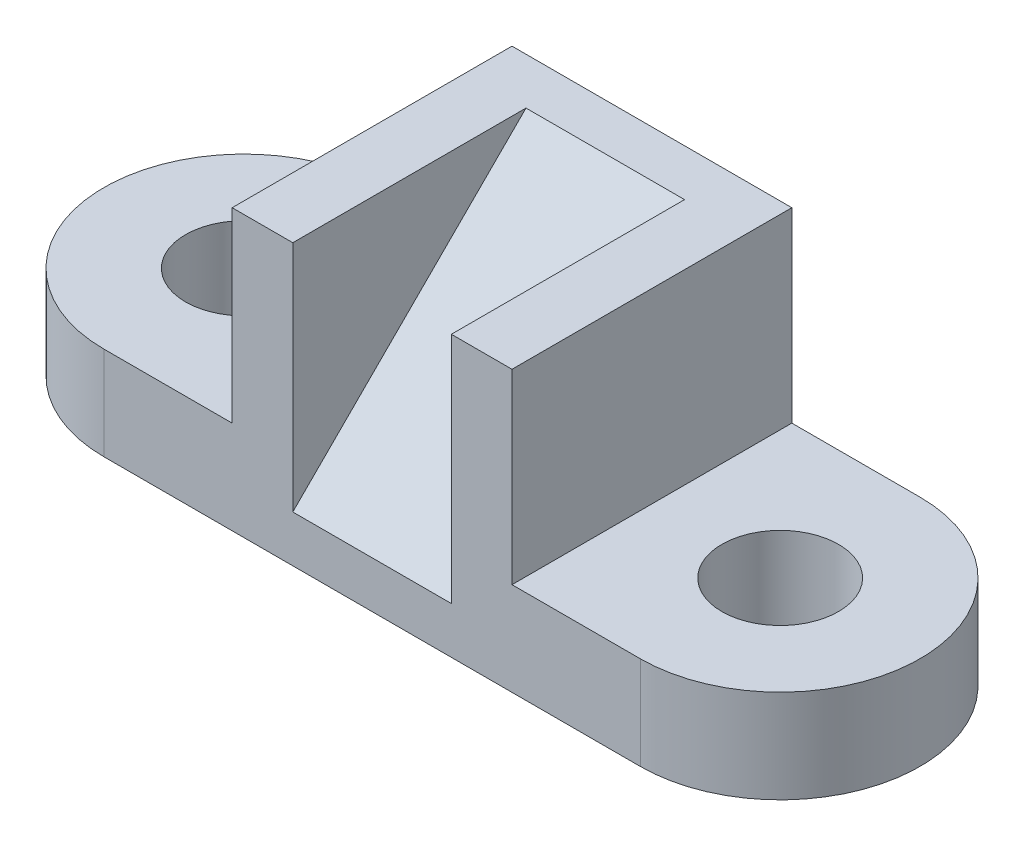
ISO-10303-21;
HEADER;
FILE_DESCRIPTION(('STEP AP214'),'2;1');
FILE_NAME('part.step','',(''),(''),'','','');
FILE_SCHEMA(('AUTOMOTIVE_DESIGN { 1 0 10303 214 1 1 1 1 }'));
ENDSEC;
DATA;
#1=APPLICATION_CONTEXT('core data for automotive mechanical design processes');
#2=APPLICATION_PROTOCOL_DEFINITION('international standard','automotive_design',2000,#1);
#3=PRODUCT_CONTEXT('',#1,'mechanical');
#4=PRODUCT('Part','Part','',(#3));
#5=PRODUCT_RELATED_PRODUCT_CATEGORY('part','',(#4));
#6=PRODUCT_DEFINITION_FORMATION('','',#4);
#7=PRODUCT_DEFINITION_CONTEXT('part definition',#1,'design');
#8=PRODUCT_DEFINITION('design','',#6,#7);
#9=PRODUCT_DEFINITION_SHAPE('','',#8);
#10=(LENGTH_UNIT() NAMED_UNIT(*) SI_UNIT(.MILLI.,.METRE.));
#11=(NAMED_UNIT(*) PLANE_ANGLE_UNIT() SI_UNIT($,.RADIAN.));
#12=(NAMED_UNIT(*) SI_UNIT($,.STERADIAN.) SOLID_ANGLE_UNIT());
#13=UNCERTAINTY_MEASURE_WITH_UNIT(LENGTH_MEASURE(1.E-05),#10,'distance_accuracy_value','');
#14=(GEOMETRIC_REPRESENTATION_CONTEXT(3) GLOBAL_UNCERTAINTY_ASSIGNED_CONTEXT((#13)) GLOBAL_UNIT_ASSIGNED_CONTEXT((#10,
#11,#12)) REPRESENTATION_CONTEXT('',''));
#15=CARTESIAN_POINT('',(0.,0.,0.));
#16=DIRECTION('',(0.,0.,1.));
#17=DIRECTION('',(1.,0.,0.));
#18=AXIS2_PLACEMENT_3D('',#15,#16,#17);
#19=CARTESIAN_POINT('',(-57.5,20.,0.));
#20=DIRECTION('',(0.,-1.,0.));
#21=DIRECTION('',(0.,0.,-1.));
#22=AXIS2_PLACEMENT_3D('',#19,#20,#21);
#23=PLANE('',#22);
#24=CARTESIAN_POINT('',(-57.5,20.,0.));
#25=DIRECTION('',(0.,1.,0.));
#26=DIRECTION('',(0.,0.,1.));
#27=AXIS2_PLACEMENT_3D('',#24,#25,#26);
#28=CIRCLE('',#27,12.5);
#29=CARTESIAN_POINT('',(-57.5,20.,12.5));
#30=VERTEX_POINT('',#29);
#31=EDGE_CURVE('E191',#30,#30,#28,.T.);
#32=ORIENTED_EDGE('',*,*,#31,.F.);
#33=EDGE_LOOP('',(#32));
#34=FACE_BOUND('',#33,.T.);
#35=DIRECTION('',(0.,0.,1.));
#36=VECTOR('',#35,1.);
#37=CARTESIAN_POINT('',(-30.,20.,-30.));
#38=LINE('',#37,#36);
#39=CARTESIAN_POINT('',(-30.,20.,-30.));
#40=VERTEX_POINT('',#39);
#41=CARTESIAN_POINT('',(-30.,20.,30.));
#42=VERTEX_POINT('',#41);
#43=EDGE_CURVE('E57',#40,#42,#38,.T.);
#44=ORIENTED_EDGE('',*,*,#43,.F.);
#45=DIRECTION('',(-1.,0.,0.));
#46=VECTOR('',#45,1.);
#47=CARTESIAN_POINT('',(-57.5,20.,-30.));
#48=LINE('',#47,#46);
#49=CARTESIAN_POINT('',(-57.5,20.,-30.));
#50=VERTEX_POINT('',#49);
#51=EDGE_CURVE('E205',#40,#50,#48,.T.);
#52=ORIENTED_EDGE('',*,*,#51,.T.);
#53=CARTESIAN_POINT('',(-57.5,20.,0.));
#54=DIRECTION('',(0.,1.,0.));
#55=DIRECTION('',(0.,0.,-1.));
#56=AXIS2_PLACEMENT_3D('',#53,#54,#55);
#57=CIRCLE('',#56,30.);
#58=CARTESIAN_POINT('',(-57.5,20.,30.));
#59=VERTEX_POINT('',#58);
#60=EDGE_CURVE('E208',#50,#59,#57,.T.);
#61=ORIENTED_EDGE('',*,*,#60,.T.);
#62=DIRECTION('',(1.,0.,0.));
#63=VECTOR('',#62,1.);
#64=CARTESIAN_POINT('',(0.,20.,30.));
#65=LINE('',#64,#63);
#66=EDGE_CURVE('E176',#59,#42,#65,.T.);
#67=ORIENTED_EDGE('',*,*,#66,.T.);
#68=EDGE_LOOP('',(#44,#52,#61,#67));
#69=FACE_BOUND('',#68,.T.);
#70=ADVANCED_FACE('F32',(#34,#69),#23,.F.);
#71=CARTESIAN_POINT('',(-57.5,0.,0.));
#72=DIRECTION('',(0.,-1.,0.));
#73=DIRECTION('',(0.,0.,-1.));
#74=AXIS2_PLACEMENT_3D('',#71,#72,#73);
#75=PLANE('',#74);
#76=DIRECTION('',(-1.,0.,0.));
#77=VECTOR('',#76,1.);
#78=CARTESIAN_POINT('',(-57.5,0.,-30.));
#79=LINE('',#78,#77);
#80=CARTESIAN_POINT('',(57.5,0.,-30.));
#81=VERTEX_POINT('',#80);
#82=CARTESIAN_POINT('',(-57.5,0.,-30.));
#83=VERTEX_POINT('',#82);
#84=EDGE_CURVE('E196',#81,#83,#79,.T.);
#85=ORIENTED_EDGE('',*,*,#84,.F.);
#86=CARTESIAN_POINT('',(57.5,0.,0.));
#87=DIRECTION('',(0.,-1.,0.));
#88=DIRECTION('',(0.,0.,-1.));
#89=AXIS2_PLACEMENT_3D('',#86,#87,#88);
#90=CIRCLE('',#89,30.);
#91=CARTESIAN_POINT('',(57.5,0.,30.));
#92=VERTEX_POINT('',#91);
#93=EDGE_CURVE('E235',#81,#92,#90,.T.);
#94=ORIENTED_EDGE('',*,*,#93,.T.);
#95=DIRECTION('',(1.,0.,0.));
#96=VECTOR('',#95,1.);
#97=CARTESIAN_POINT('',(0.,0.,30.));
#98=LINE('',#97,#96);
#99=CARTESIAN_POINT('',(-57.5,0.,30.));
#100=VERTEX_POINT('',#99);
#101=EDGE_CURVE('E203',#100,#92,#98,.T.);
#102=ORIENTED_EDGE('',*,*,#101,.F.);
#103=CARTESIAN_POINT('',(-57.5,0.,0.));
#104=DIRECTION('',(0.,1.,0.));
#105=DIRECTION('',(0.,0.,-1.));
#106=AXIS2_PLACEMENT_3D('',#103,#104,#105);
#107=CIRCLE('',#106,30.);
#108=EDGE_CURVE('E201',#83,#100,#107,.T.);
#109=ORIENTED_EDGE('',*,*,#108,.F.);
#110=EDGE_LOOP('',(#85,#94,#102,#109));
#111=FACE_BOUND('',#110,.T.);
#112=CARTESIAN_POINT('',(-57.5,0.,0.));
#113=DIRECTION('',(0.,1.,0.));
#114=DIRECTION('',(0.,0.,1.));
#115=AXIS2_PLACEMENT_3D('',#112,#113,#114);
#116=CIRCLE('',#115,12.5);
#117=CARTESIAN_POINT('',(-57.5,0.,12.5));
#118=VERTEX_POINT('',#117);
#119=EDGE_CURVE('E186',#118,#118,#116,.T.);
#120=ORIENTED_EDGE('',*,*,#119,.T.);
#121=EDGE_LOOP('',(#120));
#122=FACE_BOUND('',#121,.T.);
#123=CARTESIAN_POINT('',(57.5,0.,0.));
#124=DIRECTION('',(0.,-1.,0.));
#125=DIRECTION('',(0.,0.,1.));
#126=AXIS2_PLACEMENT_3D('',#123,#124,#125);
#127=CIRCLE('',#126,12.5);
#128=CARTESIAN_POINT('',(57.5,0.,12.5));
#129=VERTEX_POINT('',#128);
#130=EDGE_CURVE('E160',#129,#129,#127,.T.);
#131=ORIENTED_EDGE('',*,*,#130,.F.);
#132=EDGE_LOOP('',(#131));
#133=FACE_BOUND('',#132,.T.);
#134=ADVANCED_FACE('F232',(#111,#122,#133),#75,.T.);
#135=CARTESIAN_POINT('',(-57.5,20.,-30.));
#136=DIRECTION('',(0.,0.,1.));
#137=DIRECTION('',(1.,0.,0.));
#138=AXIS2_PLACEMENT_3D('',#135,#136,#137);
#139=PLANE('',#138);
#140=ORIENTED_EDGE('',*,*,#84,.T.);
#141=DIRECTION('',(0.,-1.,0.));
#142=VECTOR('',#141,1.);
#143=CARTESIAN_POINT('',(-57.5,20.,-30.));
#144=LINE('',#143,#142);
#145=EDGE_CURVE('E11',#50,#83,#144,.T.);
#146=ORIENTED_EDGE('',*,*,#145,.F.);
#147=ORIENTED_EDGE('',*,*,#51,.F.);
#148=DIRECTION('',(0.,-1.,0.));
#149=VECTOR('',#148,1.);
#150=CARTESIAN_POINT('',(-30.,60.,-30.));
#151=LINE('',#150,#149);
#152=CARTESIAN_POINT('',(-30.,60.,-30.));
#153=VERTEX_POINT('',#152);
#154=EDGE_CURVE('E182',#153,#40,#151,.T.);
#155=ORIENTED_EDGE('',*,*,#154,.F.);
#156=DIRECTION('',(-1.,0.,0.));
#157=VECTOR('',#156,1.);
#158=CARTESIAN_POINT('',(0.,60.,-30.));
#159=LINE('',#158,#157);
#160=CARTESIAN_POINT('',(30.,60.,-30.));
#161=VERTEX_POINT('',#160);
#162=EDGE_CURVE('E171',#161,#153,#159,.T.);
#163=ORIENTED_EDGE('',*,*,#162,.F.);
#164=DIRECTION('',(0.,-1.,0.));
#165=VECTOR('',#164,1.);
#166=CARTESIAN_POINT('',(30.,60.,-30.));
#167=LINE('',#166,#165);
#168=CARTESIAN_POINT('',(30.,20.,-30.));
#169=VERTEX_POINT('',#168);
#170=EDGE_CURVE('E156',#161,#169,#167,.T.);
#171=ORIENTED_EDGE('',*,*,#170,.T.);
#172=DIRECTION('',(1.,0.,0.));
#173=VECTOR('',#172,1.);
#174=CARTESIAN_POINT('',(57.5,20.,-30.));
#175=LINE('',#174,#173);
#176=CARTESIAN_POINT('',(57.5,20.,-30.));
#177=VERTEX_POINT('',#176);
#178=EDGE_CURVE('E249',#169,#177,#175,.T.);
#179=ORIENTED_EDGE('',*,*,#178,.T.);
#180=DIRECTION('',(0.,-1.,0.));
#181=VECTOR('',#180,1.);
#182=CARTESIAN_POINT('',(57.5,20.,-30.));
#183=LINE('',#182,#181);
#184=EDGE_CURVE('E165',#177,#81,#183,.T.);
#185=ORIENTED_EDGE('',*,*,#184,.T.);
#186=EDGE_LOOP('',(#140,#146,#147,#155,#163,#171,#179,#185));
#187=FACE_BOUND('',#186,.T.);
#188=ADVANCED_FACE('F34',(#187),#139,.F.);
#189=CARTESIAN_POINT('',(-57.5,20.,0.));
#190=DIRECTION('',(0.,-1.,0.));
#191=DIRECTION('',(0.,0.,-1.));
#192=AXIS2_PLACEMENT_3D('',#189,#190,#191);
#193=CYLINDRICAL_SURFACE('',#192,30.);
#194=ORIENTED_EDGE('',*,*,#108,.T.);
#195=DIRECTION('',(0.,-1.,0.));
#196=VECTOR('',#195,1.);
#197=CARTESIAN_POINT('',(-57.5,20.,30.));
#198=LINE('',#197,#196);
#199=EDGE_CURVE('E41',#59,#100,#198,.T.);
#200=ORIENTED_EDGE('',*,*,#199,.F.);
#201=ORIENTED_EDGE('',*,*,#60,.F.);
#202=ORIENTED_EDGE('',*,*,#145,.T.);
#203=EDGE_LOOP('',(#194,#200,#201,#202));
#204=FACE_BOUND('',#203,.T.);
#205=ADVANCED_FACE('F218',(#204),#193,.T.);
#206=CARTESIAN_POINT('',(0.,20.,30.));
#207=DIRECTION('',(0.,0.,-1.));
#208=DIRECTION('',(-1.,0.,0.));
#209=AXIS2_PLACEMENT_3D('',#206,#207,#208);
#210=PLANE('',#209);
#211=ORIENTED_EDGE('',*,*,#101,.T.);
#212=DIRECTION('',(0.,-1.,0.));
#213=VECTOR('',#212,1.);
#214=CARTESIAN_POINT('',(57.5,20.,30.));
#215=LINE('',#214,#213);
#216=CARTESIAN_POINT('',(57.5,20.,30.));
#217=VERTEX_POINT('',#216);
#218=EDGE_CURVE('E238',#217,#92,#215,.T.);
#219=ORIENTED_EDGE('',*,*,#218,.F.);
#220=DIRECTION('',(-1.,0.,0.));
#221=VECTOR('',#220,1.);
#222=CARTESIAN_POINT('',(0.,20.,30.));
#223=LINE('',#222,#221);
#224=CARTESIAN_POINT('',(30.,20.,30.));
#225=VERTEX_POINT('',#224);
#226=EDGE_CURVE('E151',#217,#225,#223,.T.);
#227=ORIENTED_EDGE('',*,*,#226,.T.);
#228=DIRECTION('',(0.,-1.,0.));
#229=VECTOR('',#228,1.);
#230=CARTESIAN_POINT('',(30.,60.,30.));
#231=LINE('',#230,#229);
#232=CARTESIAN_POINT('',(30.,60.,30.));
#233=VERTEX_POINT('',#232);
#234=EDGE_CURVE('E154',#233,#225,#231,.T.);
#235=ORIENTED_EDGE('',*,*,#234,.F.);
#236=DIRECTION('',(-1.,0.,0.));
#237=VECTOR('',#236,1.);
#238=CARTESIAN_POINT('',(30.,60.,30.));
#239=LINE('',#238,#237);
#240=CARTESIAN_POINT('',(17.,60.,30.));
#241=VERTEX_POINT('',#240);
#242=EDGE_CURVE('E138',#233,#241,#239,.T.);
#243=ORIENTED_EDGE('',*,*,#242,.T.);
#244=DIRECTION('',(0.,-1.,0.));
#245=VECTOR('',#244,1.);
#246=CARTESIAN_POINT('',(17.,60.,30.));
#247=LINE('',#246,#245);
#248=CARTESIAN_POINT('',(17.,10.,30.));
#249=VERTEX_POINT('',#248);
#250=EDGE_CURVE('E131',#241,#249,#247,.T.);
#251=ORIENTED_EDGE('',*,*,#250,.T.);
#252=DIRECTION('',(1.,0.,0.));
#253=VECTOR('',#252,1.);
#254=CARTESIAN_POINT('',(-17.,10.,30.));
#255=LINE('',#254,#253);
#256=CARTESIAN_POINT('',(-17.,10.,30.));
#257=VERTEX_POINT('',#256);
#258=EDGE_CURVE('E117',#257,#249,#255,.T.);
#259=ORIENTED_EDGE('',*,*,#258,.F.);
#260=DIRECTION('',(0.,-1.,0.));
#261=VECTOR('',#260,1.);
#262=CARTESIAN_POINT('',(-17.,60.,30.));
#263=LINE('',#262,#261);
#264=CARTESIAN_POINT('',(-17.,60.,30.));
#265=VERTEX_POINT('',#264);
#266=EDGE_CURVE('E163',#265,#257,#263,.T.);
#267=ORIENTED_EDGE('',*,*,#266,.F.);
#268=DIRECTION('',(1.,0.,0.));
#269=VECTOR('',#268,1.);
#270=CARTESIAN_POINT('',(-30.,60.,30.));
#271=LINE('',#270,#269);
#272=CARTESIAN_POINT('',(-30.,60.,30.));
#273=VERTEX_POINT('',#272);
#274=EDGE_CURVE('E183',#273,#265,#271,.T.);
#275=ORIENTED_EDGE('',*,*,#274,.F.);
#276=DIRECTION('',(0.,-1.,0.));
#277=VECTOR('',#276,1.);
#278=CARTESIAN_POINT('',(-30.,60.,30.));
#279=LINE('',#278,#277);
#280=EDGE_CURVE('E179',#273,#42,#279,.T.);
#281=ORIENTED_EDGE('',*,*,#280,.T.);
#282=ORIENTED_EDGE('',*,*,#66,.F.);
#283=ORIENTED_EDGE('',*,*,#199,.T.);
#284=EDGE_LOOP('',(#211,#219,#227,#235,#243,#251,#259,#267,#275,#281,#282,#283));
#285=FACE_BOUND('',#284,.T.);
#286=ADVANCED_FACE('F135',(#285),#210,.F.);
#287=CARTESIAN_POINT('',(-57.5,20.,0.));
#288=DIRECTION('',(0.,-1.,0.));
#289=DIRECTION('',(0.,0.,-1.));
#290=AXIS2_PLACEMENT_3D('',#287,#288,#289);
#291=CYLINDRICAL_SURFACE('',#290,12.5);
#292=ORIENTED_EDGE('',*,*,#31,.T.);
#293=EDGE_LOOP('',(#292));
#294=FACE_BOUND('',#293,.T.);
#295=ORIENTED_EDGE('',*,*,#119,.F.);
#296=EDGE_LOOP('',(#295));
#297=FACE_BOUND('',#296,.T.);
#298=ADVANCED_FACE('F288',(#294,#297),#291,.F.);
#299=CARTESIAN_POINT('',(-30.,60.,-30.));
#300=DIRECTION('',(1.,0.,0.));
#301=DIRECTION('',(0.,0.,-1.));
#302=AXIS2_PLACEMENT_3D('',#299,#300,#301);
#303=PLANE('',#302);
#304=ORIENTED_EDGE('',*,*,#43,.T.);
#305=ORIENTED_EDGE('',*,*,#280,.F.);
#306=DIRECTION('',(0.,0.,1.));
#307=VECTOR('',#306,1.);
#308=CARTESIAN_POINT('',(-30.,60.,-30.));
#309=LINE('',#308,#307);
#310=EDGE_CURVE('E224',#153,#273,#309,.T.);
#311=ORIENTED_EDGE('',*,*,#310,.F.);
#312=ORIENTED_EDGE('',*,*,#154,.T.);
#313=EDGE_LOOP('',(#304,#305,#311,#312));
#314=FACE_BOUND('',#313,.T.);
#315=ADVANCED_FACE('F223',(#314),#303,.F.);
#316=CARTESIAN_POINT('',(0.,60.,30.));
#317=DIRECTION('',(0.,1.,0.));
#318=DIRECTION('',(0.,0.,1.));
#319=AXIS2_PLACEMENT_3D('',#316,#317,#318);
#320=PLANE('',#319);
#321=DIRECTION('',(1.,0.,0.));
#322=VECTOR('',#321,1.);
#323=CARTESIAN_POINT('',(-17.,60.,-20.));
#324=LINE('',#323,#322);
#325=CARTESIAN_POINT('',(-17.,60.,-20.));
#326=VERTEX_POINT('',#325);
#327=CARTESIAN_POINT('',(17.,60.,-20.));
#328=VERTEX_POINT('',#327);
#329=EDGE_CURVE('E125',#326,#328,#324,.T.);
#330=ORIENTED_EDGE('',*,*,#329,.T.);
#331=DIRECTION('',(0.,0.,1.));
#332=VECTOR('',#331,1.);
#333=CARTESIAN_POINT('',(17.,60.,-20.));
#334=LINE('',#333,#332);
#335=EDGE_CURVE('E133',#328,#241,#334,.T.);
#336=ORIENTED_EDGE('',*,*,#335,.T.);
#337=ORIENTED_EDGE('',*,*,#242,.F.);
#338=DIRECTION('',(0.,0.,1.));
#339=VECTOR('',#338,1.);
#340=CARTESIAN_POINT('',(30.,60.,-30.));
#341=LINE('',#340,#339);
#342=EDGE_CURVE('E145',#161,#233,#341,.T.);
#343=ORIENTED_EDGE('',*,*,#342,.F.);
#344=ORIENTED_EDGE('',*,*,#162,.T.);
#345=ORIENTED_EDGE('',*,*,#310,.T.);
#346=ORIENTED_EDGE('',*,*,#274,.T.);
#347=DIRECTION('',(0.,0.,1.));
#348=VECTOR('',#347,1.);
#349=CARTESIAN_POINT('',(-17.,60.,-20.));
#350=LINE('',#349,#348);
#351=EDGE_CURVE('E126',#326,#265,#350,.T.);
#352=ORIENTED_EDGE('',*,*,#351,.F.);
#353=EDGE_LOOP('',(#330,#336,#337,#343,#344,#345,#346,#352));
#354=FACE_BOUND('',#353,.T.);
#355=ADVANCED_FACE('F227',(#354),#320,.T.);
#356=CARTESIAN_POINT('',(-17.,10.,30.));
#357=DIRECTION('',(0.,-0.707106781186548,-0.707106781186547));
#358=DIRECTION('',(0.,0.707106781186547,-0.707106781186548));
#359=AXIS2_PLACEMENT_3D('',#356,#357,#358);
#360=PLANE('',#359);
#361=ORIENTED_EDGE('',*,*,#258,.T.);
#362=DIRECTION('',(0.,0.707106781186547,-0.707106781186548));
#363=VECTOR('',#362,1.);
#364=CARTESIAN_POINT('',(17.,10.,30.));
#365=LINE('',#364,#363);
#366=EDGE_CURVE('E120',#249,#328,#365,.T.);
#367=ORIENTED_EDGE('',*,*,#366,.T.);
#368=ORIENTED_EDGE('',*,*,#329,.F.);
#369=DIRECTION('',(0.,0.707106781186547,-0.707106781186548));
#370=VECTOR('',#369,1.);
#371=CARTESIAN_POINT('',(-17.,10.,30.));
#372=LINE('',#371,#370);
#373=EDGE_CURVE('E49',#257,#326,#372,.T.);
#374=ORIENTED_EDGE('',*,*,#373,.F.);
#375=EDGE_LOOP('',(#361,#367,#368,#374));
#376=FACE_BOUND('',#375,.T.);
#377=ADVANCED_FACE('F119',(#376),#360,.F.);
#378=CARTESIAN_POINT('',(-17.,60.,30.));
#379=DIRECTION('',(-1.,0.,0.));
#380=DIRECTION('',(0.,0.,1.));
#381=AXIS2_PLACEMENT_3D('',#378,#379,#380);
#382=PLANE('',#381);
#383=ORIENTED_EDGE('',*,*,#266,.T.);
#384=ORIENTED_EDGE('',*,*,#373,.T.);
#385=ORIENTED_EDGE('',*,*,#351,.T.);
#386=EDGE_LOOP('',(#383,#384,#385));
#387=FACE_BOUND('',#386,.T.);
#388=ADVANCED_FACE('F266',(#387),#382,.F.);
#389=CARTESIAN_POINT('',(57.5,20.,0.));
#390=DIRECTION('',(0.,-1.,0.));
#391=DIRECTION('',(0.,0.,-1.));
#392=AXIS2_PLACEMENT_3D('',#389,#390,#391);
#393=PLANE('',#392);
#394=CARTESIAN_POINT('',(57.5,20.,0.));
#395=DIRECTION('',(0.,-1.,0.));
#396=DIRECTION('',(0.,0.,1.));
#397=AXIS2_PLACEMENT_3D('',#394,#395,#396);
#398=CIRCLE('',#397,12.5);
#399=CARTESIAN_POINT('',(57.5,20.,12.5));
#400=VERTEX_POINT('',#399);
#401=EDGE_CURVE('E255',#400,#400,#398,.T.);
#402=ORIENTED_EDGE('',*,*,#401,.T.);
#403=EDGE_LOOP('',(#402));
#404=FACE_BOUND('',#403,.T.);
#405=DIRECTION('',(0.,0.,1.));
#406=VECTOR('',#405,1.);
#407=CARTESIAN_POINT('',(30.,20.,-30.));
#408=LINE('',#407,#406);
#409=EDGE_CURVE('E142',#169,#225,#408,.T.);
#410=ORIENTED_EDGE('',*,*,#409,.T.);
#411=ORIENTED_EDGE('',*,*,#226,.F.);
#412=CARTESIAN_POINT('',(57.5,20.,0.));
#413=DIRECTION('',(0.,-1.,0.));
#414=DIRECTION('',(0.,0.,-1.));
#415=AXIS2_PLACEMENT_3D('',#412,#413,#414);
#416=CIRCLE('',#415,30.);
#417=EDGE_CURVE('E243',#177,#217,#416,.T.);
#418=ORIENTED_EDGE('',*,*,#417,.F.);
#419=ORIENTED_EDGE('',*,*,#178,.F.);
#420=EDGE_LOOP('',(#410,#411,#418,#419));
#421=FACE_BOUND('',#420,.T.);
#422=ADVANCED_FACE('F264',(#404,#421),#393,.F.);
#423=CARTESIAN_POINT('',(57.5,20.,0.));
#424=DIRECTION('',(0.,-1.,0.));
#425=DIRECTION('',(0.,0.,-1.));
#426=AXIS2_PLACEMENT_3D('',#423,#424,#425);
#427=CYLINDRICAL_SURFACE('',#426,30.);
#428=ORIENTED_EDGE('',*,*,#93,.F.);
#429=ORIENTED_EDGE('',*,*,#184,.F.);
#430=ORIENTED_EDGE('',*,*,#417,.T.);
#431=ORIENTED_EDGE('',*,*,#218,.T.);
#432=EDGE_LOOP('',(#428,#429,#430,#431));
#433=FACE_BOUND('',#432,.T.);
#434=ADVANCED_FACE('F241',(#433),#427,.T.);
#435=CARTESIAN_POINT('',(57.5,20.,0.));
#436=DIRECTION('',(0.,-1.,0.));
#437=DIRECTION('',(0.,0.,-1.));
#438=AXIS2_PLACEMENT_3D('',#435,#436,#437);
#439=CYLINDRICAL_SURFACE('',#438,12.5);
#440=ORIENTED_EDGE('',*,*,#401,.F.);
#441=EDGE_LOOP('',(#440));
#442=FACE_BOUND('',#441,.T.);
#443=ORIENTED_EDGE('',*,*,#130,.T.);
#444=EDGE_LOOP('',(#443));
#445=FACE_BOUND('',#444,.T.);
#446=ADVANCED_FACE('F273',(#442,#445),#439,.F.);
#447=CARTESIAN_POINT('',(30.,60.,-30.));
#448=DIRECTION('',(-1.,0.,0.));
#449=DIRECTION('',(0.,0.,-1.));
#450=AXIS2_PLACEMENT_3D('',#447,#448,#449);
#451=PLANE('',#450);
#452=ORIENTED_EDGE('',*,*,#409,.F.);
#453=ORIENTED_EDGE('',*,*,#170,.F.);
#454=ORIENTED_EDGE('',*,*,#342,.T.);
#455=ORIENTED_EDGE('',*,*,#234,.T.);
#456=EDGE_LOOP('',(#452,#453,#454,#455));
#457=FACE_BOUND('',#456,.T.);
#458=ADVANCED_FACE('F261',(#457),#451,.F.);
#459=CARTESIAN_POINT('',(17.,60.,30.));
#460=DIRECTION('',(1.,0.,0.));
#461=DIRECTION('',(0.,0.,1.));
#462=AXIS2_PLACEMENT_3D('',#459,#460,#461);
#463=PLANE('',#462);
#464=ORIENTED_EDGE('',*,*,#250,.F.);
#465=ORIENTED_EDGE('',*,*,#335,.F.);
#466=ORIENTED_EDGE('',*,*,#366,.F.);
#467=EDGE_LOOP('',(#464,#465,#466));
#468=FACE_BOUND('',#467,.T.);
#469=ADVANCED_FACE('F130',(#468),#463,.F.);
#470=CLOSED_SHELL('',(#70,#134,#188,#205,#286,#298,#315,#355,#377,#388,#422,#434,#446,#458,#469));
#471=MANIFOLD_SOLID_BREP('B2',#470);
#472=ADVANCED_BREP_SHAPE_REPRESENTATION('',(#18,#471),#14);
#473=SHAPE_DEFINITION_REPRESENTATION(#9,#472);
ENDSEC;
END-ISO-10303-21;
